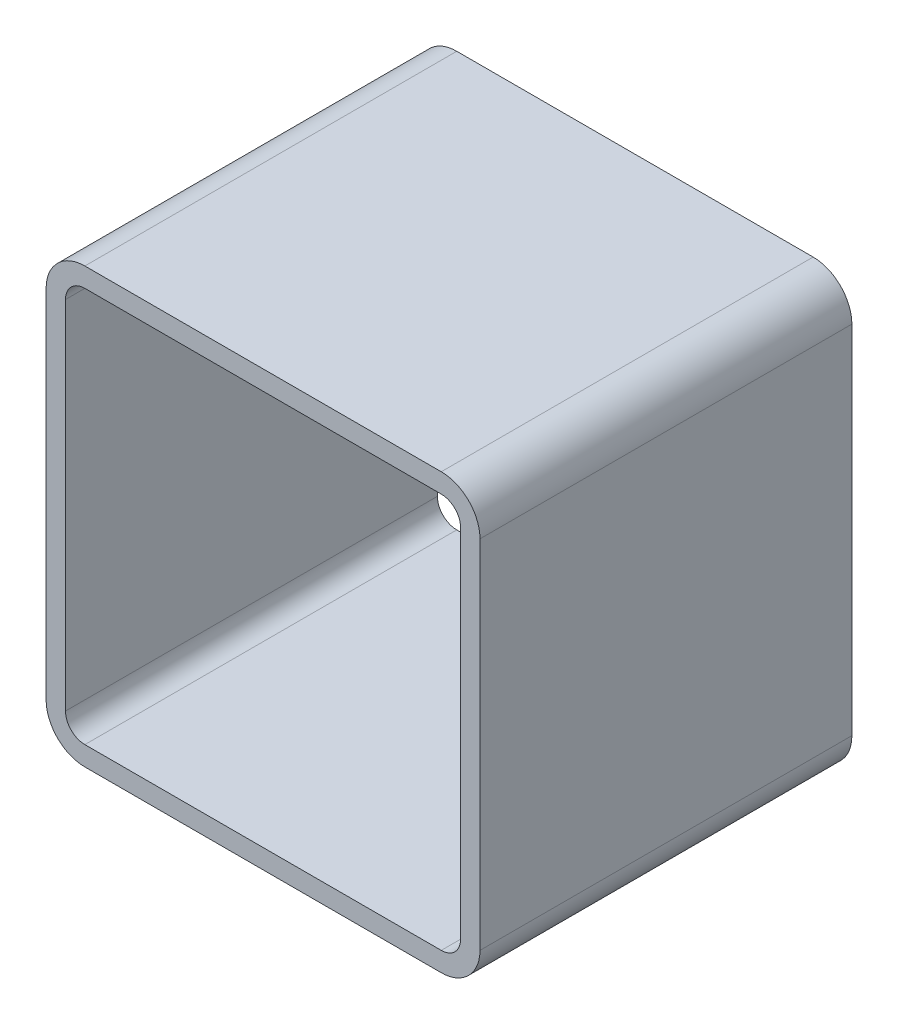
ISO-10303-21;
HEADER;
FILE_DESCRIPTION(('STEP AP214'),'2;1');
FILE_NAME('part.step','',(''),(''),'','','');
FILE_SCHEMA(('AUTOMOTIVE_DESIGN { 1 0 10303 214 1 1 1 1 }'));
ENDSEC;
DATA;
#1=APPLICATION_CONTEXT('core data for automotive mechanical design processes');
#2=APPLICATION_PROTOCOL_DEFINITION('international standard','automotive_design',2000,#1);
#3=PRODUCT_CONTEXT('',#1,'mechanical');
#4=PRODUCT('Part','Part','',(#3));
#5=PRODUCT_RELATED_PRODUCT_CATEGORY('part','',(#4));
#6=PRODUCT_DEFINITION_FORMATION('','',#4);
#7=PRODUCT_DEFINITION_CONTEXT('part definition',#1,'design');
#8=PRODUCT_DEFINITION('design','',#6,#7);
#9=PRODUCT_DEFINITION_SHAPE('','',#8);
#10=(LENGTH_UNIT() NAMED_UNIT(*) SI_UNIT(.MILLI.,.METRE.));
#11=(NAMED_UNIT(*) PLANE_ANGLE_UNIT() SI_UNIT($,.RADIAN.));
#12=(NAMED_UNIT(*) SI_UNIT($,.STERADIAN.) SOLID_ANGLE_UNIT());
#13=UNCERTAINTY_MEASURE_WITH_UNIT(LENGTH_MEASURE(1.E-05),#10,'distance_accuracy_value','');
#14=(GEOMETRIC_REPRESENTATION_CONTEXT(3) GLOBAL_UNCERTAINTY_ASSIGNED_CONTEXT((#13)) GLOBAL_UNIT_ASSIGNED_CONTEXT((#10,
#11,#12)) REPRESENTATION_CONTEXT('',''));
#15=CARTESIAN_POINT('',(0.,0.,0.));
#16=DIRECTION('',(0.,0.,1.));
#17=DIRECTION('',(1.,0.,0.));
#18=AXIS2_PLACEMENT_3D('',#15,#16,#17);
#19=CARTESIAN_POINT('',(34.2003420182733,325.678679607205,304.8));
#20=DIRECTION('',(0.,0.,1.));
#21=DIRECTION('',(1.,0.,0.));
#22=AXIS2_PLACEMENT_3D('',#19,#20,#21);
#23=PLANE('',#22);
#24=CARTESIAN_POINT('',(34.2003420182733,325.678679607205,304.8));
#25=DIRECTION('',(0.,0.,1.));
#26=DIRECTION('',(1.,0.,0.));
#27=AXIS2_PLACEMENT_3D('',#24,#25,#26);
#28=CIRCLE('',#27,31.75);
#29=CARTESIAN_POINT('',(34.2003420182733,357.428679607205,304.8));
#30=VERTEX_POINT('',#29);
#31=CARTESIAN_POINT('',(2.45034201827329,325.678679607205,304.8));
#32=VERTEX_POINT('',#31);
#33=EDGE_CURVE('E211',#30,#32,#28,.T.);
#34=ORIENTED_EDGE('',*,*,#33,.T.);
#35=DIRECTION('',(0.,-1.,0.));
#36=VECTOR('',#35,1.);
#37=CARTESIAN_POINT('',(2.45034201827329,33.5786796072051,304.8));
#38=LINE('',#37,#36);
#39=CARTESIAN_POINT('',(2.45034201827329,33.5786796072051,304.8));
#40=VERTEX_POINT('',#39);
#41=EDGE_CURVE('E214',#32,#40,#38,.T.);
#42=ORIENTED_EDGE('',*,*,#41,.T.);
#43=CARTESIAN_POINT('',(34.2003420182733,33.5786796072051,304.8));
#44=DIRECTION('',(0.,0.,1.));
#45=DIRECTION('',(1.,0.,0.));
#46=AXIS2_PLACEMENT_3D('',#43,#44,#45);
#47=CIRCLE('',#46,31.75);
#48=CARTESIAN_POINT('',(34.2003420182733,1.82867960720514,304.8));
#49=VERTEX_POINT('',#48);
#50=EDGE_CURVE('E217',#40,#49,#47,.T.);
#51=ORIENTED_EDGE('',*,*,#50,.T.);
#52=DIRECTION('',(1.,0.,0.));
#53=VECTOR('',#52,1.);
#54=CARTESIAN_POINT('',(326.300342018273,1.82867960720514,304.8));
#55=LINE('',#54,#53);
#56=CARTESIAN_POINT('',(326.300342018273,1.82867960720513,304.8));
#57=VERTEX_POINT('',#56);
#58=EDGE_CURVE('E219',#49,#57,#55,.T.);
#59=ORIENTED_EDGE('',*,*,#58,.T.);
#60=CARTESIAN_POINT('',(326.300342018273,33.5786796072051,304.8));
#61=DIRECTION('',(0.,0.,1.));
#62=DIRECTION('',(1.,0.,0.));
#63=AXIS2_PLACEMENT_3D('',#60,#61,#62);
#64=CIRCLE('',#63,31.75);
#65=CARTESIAN_POINT('',(358.050342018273,33.5786796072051,304.8));
#66=VERTEX_POINT('',#65);
#67=EDGE_CURVE('E221',#57,#66,#64,.T.);
#68=ORIENTED_EDGE('',*,*,#67,.T.);
#69=DIRECTION('',(0.,1.,0.));
#70=VECTOR('',#69,1.);
#71=CARTESIAN_POINT('',(358.050342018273,325.678679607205,304.8));
#72=LINE('',#71,#70);
#73=CARTESIAN_POINT('',(358.050342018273,325.678679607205,304.8));
#74=VERTEX_POINT('',#73);
#75=EDGE_CURVE('E223',#66,#74,#72,.T.);
#76=ORIENTED_EDGE('',*,*,#75,.T.);
#77=CARTESIAN_POINT('',(326.300342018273,325.678679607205,304.8));
#78=DIRECTION('',(0.,0.,1.));
#79=DIRECTION('',(1.,0.,0.));
#80=AXIS2_PLACEMENT_3D('',#77,#78,#79);
#81=CIRCLE('',#80,31.75);
#82=CARTESIAN_POINT('',(326.300342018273,357.428679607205,304.8));
#83=VERTEX_POINT('',#82);
#84=EDGE_CURVE('E225',#74,#83,#81,.T.);
#85=ORIENTED_EDGE('',*,*,#84,.T.);
#86=DIRECTION('',(-1.,0.,0.));
#87=VECTOR('',#86,1.);
#88=CARTESIAN_POINT('',(34.2003420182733,357.428679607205,304.8));
#89=LINE('',#88,#87);
#90=EDGE_CURVE('E227',#83,#30,#89,.T.);
#91=ORIENTED_EDGE('',*,*,#90,.T.);
#92=EDGE_LOOP('',(#34,#42,#51,#59,#68,#76,#85,#91));
#93=FACE_BOUND('',#92,.T.);
#94=DIRECTION('',(0.,-1.,0.));
#95=VECTOR('',#94,1.);
#96=CARTESIAN_POINT('',(18.3253420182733,33.5786796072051,304.8));
#97=LINE('',#96,#95);
#98=CARTESIAN_POINT('',(18.3253420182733,325.678679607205,304.8));
#99=VERTEX_POINT('',#98);
#100=CARTESIAN_POINT('',(18.3253420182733,33.5786796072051,304.8));
#101=VERTEX_POINT('',#100);
#102=EDGE_CURVE('E154',#99,#101,#97,.T.);
#103=ORIENTED_EDGE('',*,*,#102,.F.);
#104=CARTESIAN_POINT('',(34.2003420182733,325.678679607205,304.8));
#105=DIRECTION('',(0.,0.,1.));
#106=DIRECTION('',(1.,0.,0.));
#107=AXIS2_PLACEMENT_3D('',#104,#105,#106);
#108=CIRCLE('',#107,15.875);
#109=CARTESIAN_POINT('',(34.2003420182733,341.553679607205,304.8));
#110=VERTEX_POINT('',#109);
#111=EDGE_CURVE('E146',#110,#99,#108,.T.);
#112=ORIENTED_EDGE('',*,*,#111,.F.);
#113=DIRECTION('',(-1.,0.,0.));
#114=VECTOR('',#113,1.);
#115=CARTESIAN_POINT('',(34.2003420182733,341.553679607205,304.8));
#116=LINE('',#115,#114);
#117=CARTESIAN_POINT('',(326.300342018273,341.553679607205,304.8));
#118=VERTEX_POINT('',#117);
#119=EDGE_CURVE('E179',#118,#110,#116,.T.);
#120=ORIENTED_EDGE('',*,*,#119,.F.);
#121=CARTESIAN_POINT('',(326.300342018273,325.678679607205,304.8));
#122=DIRECTION('',(0.,0.,1.));
#123=DIRECTION('',(1.,0.,0.));
#124=AXIS2_PLACEMENT_3D('',#121,#122,#123);
#125=CIRCLE('',#124,15.875);
#126=CARTESIAN_POINT('',(342.175342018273,325.678679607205,304.8));
#127=VERTEX_POINT('',#126);
#128=EDGE_CURVE('E177',#127,#118,#125,.T.);
#129=ORIENTED_EDGE('',*,*,#128,.F.);
#130=DIRECTION('',(0.,1.,0.));
#131=VECTOR('',#130,1.);
#132=CARTESIAN_POINT('',(342.175342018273,325.678679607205,304.8));
#133=LINE('',#132,#131);
#134=CARTESIAN_POINT('',(342.175342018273,33.5786796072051,304.8));
#135=VERTEX_POINT('',#134);
#136=EDGE_CURVE('E175',#135,#127,#133,.T.);
#137=ORIENTED_EDGE('',*,*,#136,.F.);
#138=CARTESIAN_POINT('',(326.300342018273,33.5786796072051,304.8));
#139=DIRECTION('',(0.,0.,1.));
#140=DIRECTION('',(1.,0.,0.));
#141=AXIS2_PLACEMENT_3D('',#138,#139,#140);
#142=CIRCLE('',#141,15.875);
#143=CARTESIAN_POINT('',(326.300342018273,17.7036796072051,304.8));
#144=VERTEX_POINT('',#143);
#145=EDGE_CURVE('E173',#144,#135,#142,.T.);
#146=ORIENTED_EDGE('',*,*,#145,.F.);
#147=DIRECTION('',(1.,0.,0.));
#148=VECTOR('',#147,1.);
#149=CARTESIAN_POINT('',(326.300342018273,17.7036796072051,304.8));
#150=LINE('',#149,#148);
#151=CARTESIAN_POINT('',(34.2003420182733,17.7036796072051,304.8));
#152=VERTEX_POINT('',#151);
#153=EDGE_CURVE('E169',#152,#144,#150,.T.);
#154=ORIENTED_EDGE('',*,*,#153,.F.);
#155=CARTESIAN_POINT('',(34.2003420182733,33.5786796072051,304.8));
#156=DIRECTION('',(0.,0.,1.));
#157=DIRECTION('',(1.,0.,0.));
#158=AXIS2_PLACEMENT_3D('',#155,#156,#157);
#159=CIRCLE('',#158,15.875);
#160=EDGE_CURVE('E167',#101,#152,#159,.T.);
#161=ORIENTED_EDGE('',*,*,#160,.F.);
#162=EDGE_LOOP('',(#103,#112,#120,#129,#137,#146,#154,#161));
#163=FACE_BOUND('',#162,.T.);
#164=ADVANCED_FACE('F33',(#93,#163),#23,.T.);
#165=CARTESIAN_POINT('',(34.2003420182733,325.678679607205,0.));
#166=DIRECTION('',(0.,0.,1.));
#167=DIRECTION('',(1.,0.,0.));
#168=AXIS2_PLACEMENT_3D('',#165,#166,#167);
#169=PLANE('',#168);
#170=CARTESIAN_POINT('',(34.2003420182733,325.678679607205,0.));
#171=DIRECTION('',(0.,0.,1.));
#172=DIRECTION('',(1.,0.,0.));
#173=AXIS2_PLACEMENT_3D('',#170,#171,#172);
#174=CIRCLE('',#173,31.75);
#175=CARTESIAN_POINT('',(34.2003420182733,357.428679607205,0.));
#176=VERTEX_POINT('',#175);
#177=CARTESIAN_POINT('',(2.45034201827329,325.678679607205,0.));
#178=VERTEX_POINT('',#177);
#179=EDGE_CURVE('E162',#176,#178,#174,.T.);
#180=ORIENTED_EDGE('',*,*,#179,.F.);
#181=DIRECTION('',(-1.,0.,0.));
#182=VECTOR('',#181,1.);
#183=CARTESIAN_POINT('',(34.2003420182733,357.428679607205,0.));
#184=LINE('',#183,#182);
#185=CARTESIAN_POINT('',(326.300342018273,357.428679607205,0.));
#186=VERTEX_POINT('',#185);
#187=EDGE_CURVE('E215',#186,#176,#184,.T.);
#188=ORIENTED_EDGE('',*,*,#187,.F.);
#189=CARTESIAN_POINT('',(326.300342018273,325.678679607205,0.));
#190=DIRECTION('',(0.,0.,1.));
#191=DIRECTION('',(1.,0.,0.));
#192=AXIS2_PLACEMENT_3D('',#189,#190,#191);
#193=CIRCLE('',#192,31.75);
#194=CARTESIAN_POINT('',(358.050342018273,325.678679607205,0.));
#195=VERTEX_POINT('',#194);
#196=EDGE_CURVE('E242',#195,#186,#193,.T.);
#197=ORIENTED_EDGE('',*,*,#196,.F.);
#198=DIRECTION('',(0.,1.,0.));
#199=VECTOR('',#198,1.);
#200=CARTESIAN_POINT('',(358.050342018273,325.678679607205,0.));
#201=LINE('',#200,#199);
#202=CARTESIAN_POINT('',(358.050342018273,33.5786796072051,0.));
#203=VERTEX_POINT('',#202);
#204=EDGE_CURVE('E240',#203,#195,#201,.T.);
#205=ORIENTED_EDGE('',*,*,#204,.F.);
#206=CARTESIAN_POINT('',(326.300342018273,33.5786796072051,0.));
#207=DIRECTION('',(0.,0.,1.));
#208=DIRECTION('',(1.,0.,0.));
#209=AXIS2_PLACEMENT_3D('',#206,#207,#208);
#210=CIRCLE('',#209,31.75);
#211=CARTESIAN_POINT('',(326.300342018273,1.82867960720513,0.));
#212=VERTEX_POINT('',#211);
#213=EDGE_CURVE('E238',#212,#203,#210,.T.);
#214=ORIENTED_EDGE('',*,*,#213,.F.);
#215=DIRECTION('',(1.,0.,0.));
#216=VECTOR('',#215,1.);
#217=CARTESIAN_POINT('',(326.300342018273,1.82867960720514,0.));
#218=LINE('',#217,#216);
#219=CARTESIAN_POINT('',(34.2003420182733,1.82867960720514,0.));
#220=VERTEX_POINT('',#219);
#221=EDGE_CURVE('E236',#220,#212,#218,.T.);
#222=ORIENTED_EDGE('',*,*,#221,.F.);
#223=CARTESIAN_POINT('',(34.2003420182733,33.5786796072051,0.));
#224=DIRECTION('',(0.,0.,1.));
#225=DIRECTION('',(1.,0.,0.));
#226=AXIS2_PLACEMENT_3D('',#223,#224,#225);
#227=CIRCLE('',#226,31.75);
#228=CARTESIAN_POINT('',(2.45034201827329,33.5786796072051,0.));
#229=VERTEX_POINT('',#228);
#230=EDGE_CURVE('E234',#229,#220,#227,.T.);
#231=ORIENTED_EDGE('',*,*,#230,.F.);
#232=DIRECTION('',(0.,-1.,0.));
#233=VECTOR('',#232,1.);
#234=CARTESIAN_POINT('',(2.45034201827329,33.5786796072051,0.));
#235=LINE('',#234,#233);
#236=EDGE_CURVE('E232',#178,#229,#235,.T.);
#237=ORIENTED_EDGE('',*,*,#236,.F.);
#238=EDGE_LOOP('',(#180,#188,#197,#205,#214,#222,#231,#237));
#239=FACE_BOUND('',#238,.T.);
#240=CARTESIAN_POINT('',(34.2003420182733,325.678679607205,0.));
#241=DIRECTION('',(0.,0.,1.));
#242=DIRECTION('',(1.,0.,0.));
#243=AXIS2_PLACEMENT_3D('',#240,#241,#242);
#244=CIRCLE('',#243,15.875);
#245=CARTESIAN_POINT('',(34.2003420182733,341.553679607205,0.));
#246=VERTEX_POINT('',#245);
#247=CARTESIAN_POINT('',(18.3253420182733,325.678679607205,0.));
#248=VERTEX_POINT('',#247);
#249=EDGE_CURVE('E56',#246,#248,#244,.T.);
#250=ORIENTED_EDGE('',*,*,#249,.T.);
#251=DIRECTION('',(0.,-1.,0.));
#252=VECTOR('',#251,1.);
#253=CARTESIAN_POINT('',(18.3253420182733,33.5786796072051,0.));
#254=LINE('',#253,#252);
#255=CARTESIAN_POINT('',(18.3253420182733,33.5786796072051,0.));
#256=VERTEX_POINT('',#255);
#257=EDGE_CURVE('E161',#248,#256,#254,.T.);
#258=ORIENTED_EDGE('',*,*,#257,.T.);
#259=CARTESIAN_POINT('',(34.2003420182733,33.5786796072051,0.));
#260=DIRECTION('',(0.,0.,1.));
#261=DIRECTION('',(1.,0.,0.));
#262=AXIS2_PLACEMENT_3D('',#259,#260,#261);
#263=CIRCLE('',#262,15.875);
#264=CARTESIAN_POINT('',(34.2003420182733,17.7036796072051,0.));
#265=VERTEX_POINT('',#264);
#266=EDGE_CURVE('E183',#256,#265,#263,.T.);
#267=ORIENTED_EDGE('',*,*,#266,.T.);
#268=DIRECTION('',(1.,0.,0.));
#269=VECTOR('',#268,1.);
#270=CARTESIAN_POINT('',(326.300342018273,17.7036796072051,0.));
#271=LINE('',#270,#269);
#272=CARTESIAN_POINT('',(326.300342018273,17.7036796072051,0.));
#273=VERTEX_POINT('',#272);
#274=EDGE_CURVE('E186',#265,#273,#271,.T.);
#275=ORIENTED_EDGE('',*,*,#274,.T.);
#276=CARTESIAN_POINT('',(326.300342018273,33.5786796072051,0.));
#277=DIRECTION('',(0.,0.,1.));
#278=DIRECTION('',(1.,0.,0.));
#279=AXIS2_PLACEMENT_3D('',#276,#277,#278);
#280=CIRCLE('',#279,15.875);
#281=CARTESIAN_POINT('',(342.175342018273,33.5786796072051,0.));
#282=VERTEX_POINT('',#281);
#283=EDGE_CURVE('E189',#273,#282,#280,.T.);
#284=ORIENTED_EDGE('',*,*,#283,.T.);
#285=DIRECTION('',(0.,1.,0.));
#286=VECTOR('',#285,1.);
#287=CARTESIAN_POINT('',(342.175342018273,325.678679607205,0.));
#288=LINE('',#287,#286);
#289=CARTESIAN_POINT('',(342.175342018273,325.678679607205,0.));
#290=VERTEX_POINT('',#289);
#291=EDGE_CURVE('E192',#282,#290,#288,.T.);
#292=ORIENTED_EDGE('',*,*,#291,.T.);
#293=CARTESIAN_POINT('',(326.300342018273,325.678679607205,0.));
#294=DIRECTION('',(0.,0.,1.));
#295=DIRECTION('',(1.,0.,0.));
#296=AXIS2_PLACEMENT_3D('',#293,#294,#295);
#297=CIRCLE('',#296,15.875);
#298=CARTESIAN_POINT('',(326.300342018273,341.553679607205,0.));
#299=VERTEX_POINT('',#298);
#300=EDGE_CURVE('E195',#290,#299,#297,.T.);
#301=ORIENTED_EDGE('',*,*,#300,.T.);
#302=DIRECTION('',(-1.,0.,0.));
#303=VECTOR('',#302,1.);
#304=CARTESIAN_POINT('',(34.2003420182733,341.553679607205,0.));
#305=LINE('',#304,#303);
#306=EDGE_CURVE('E155',#299,#246,#305,.T.);
#307=ORIENTED_EDGE('',*,*,#306,.T.);
#308=EDGE_LOOP('',(#250,#258,#267,#275,#284,#292,#301,#307));
#309=FACE_BOUND('',#308,.T.);
#310=ADVANCED_FACE('F272',(#239,#309),#169,.F.);
#311=CARTESIAN_POINT('',(34.2003420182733,325.678679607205,304.8));
#312=DIRECTION('',(0.,0.,-1.));
#313=DIRECTION('',(-1.,0.,0.));
#314=AXIS2_PLACEMENT_3D('',#311,#312,#313);
#315=CYLINDRICAL_SURFACE('',#314,31.75);
#316=ORIENTED_EDGE('',*,*,#179,.T.);
#317=DIRECTION('',(0.,0.,-1.));
#318=VECTOR('',#317,1.);
#319=CARTESIAN_POINT('',(2.45034201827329,325.678679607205,304.8));
#320=LINE('',#319,#318);
#321=EDGE_CURVE('E11',#32,#178,#320,.T.);
#322=ORIENTED_EDGE('',*,*,#321,.F.);
#323=ORIENTED_EDGE('',*,*,#33,.F.);
#324=DIRECTION('',(0.,0.,-1.));
#325=VECTOR('',#324,1.);
#326=CARTESIAN_POINT('',(34.2003420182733,357.428679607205,304.8));
#327=LINE('',#326,#325);
#328=EDGE_CURVE('E229',#30,#176,#327,.T.);
#329=ORIENTED_EDGE('',*,*,#328,.T.);
#330=EDGE_LOOP('',(#316,#322,#323,#329));
#331=FACE_BOUND('',#330,.T.);
#332=ADVANCED_FACE('F35',(#331),#315,.T.);
#333=CARTESIAN_POINT('',(2.45034201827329,33.5786796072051,304.8));
#334=DIRECTION('',(1.,0.,0.));
#335=DIRECTION('',(0.,0.,-1.));
#336=AXIS2_PLACEMENT_3D('',#333,#334,#335);
#337=PLANE('',#336);
#338=ORIENTED_EDGE('',*,*,#236,.T.);
#339=DIRECTION('',(0.,0.,-1.));
#340=VECTOR('',#339,1.);
#341=CARTESIAN_POINT('',(2.45034201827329,33.5786796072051,304.8));
#342=LINE('',#341,#340);
#343=EDGE_CURVE('E41',#40,#229,#342,.T.);
#344=ORIENTED_EDGE('',*,*,#343,.F.);
#345=ORIENTED_EDGE('',*,*,#41,.F.);
#346=ORIENTED_EDGE('',*,*,#321,.T.);
#347=EDGE_LOOP('',(#338,#344,#345,#346));
#348=FACE_BOUND('',#347,.T.);
#349=ADVANCED_FACE('F289',(#348),#337,.F.);
#350=CARTESIAN_POINT('',(34.2003420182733,33.5786796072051,304.8));
#351=DIRECTION('',(0.,0.,-1.));
#352=DIRECTION('',(-1.,0.,0.));
#353=AXIS2_PLACEMENT_3D('',#350,#351,#352);
#354=CYLINDRICAL_SURFACE('',#353,31.75);
#355=ORIENTED_EDGE('',*,*,#230,.T.);
#356=DIRECTION('',(0.,0.,-1.));
#357=VECTOR('',#356,1.);
#358=CARTESIAN_POINT('',(34.2003420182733,1.82867960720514,304.8));
#359=LINE('',#358,#357);
#360=EDGE_CURVE('E259',#49,#220,#359,.T.);
#361=ORIENTED_EDGE('',*,*,#360,.F.);
#362=ORIENTED_EDGE('',*,*,#50,.F.);
#363=ORIENTED_EDGE('',*,*,#343,.T.);
#364=EDGE_LOOP('',(#355,#361,#362,#363));
#365=FACE_BOUND('',#364,.T.);
#366=ADVANCED_FACE('F266',(#365),#354,.T.);
#367=CARTESIAN_POINT('',(326.300342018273,1.82867960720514,304.8));
#368=DIRECTION('',(0.,1.,0.));
#369=DIRECTION('',(0.,0.,1.));
#370=AXIS2_PLACEMENT_3D('',#367,#368,#369);
#371=PLANE('',#370);
#372=ORIENTED_EDGE('',*,*,#221,.T.);
#373=DIRECTION('',(0.,0.,-1.));
#374=VECTOR('',#373,1.);
#375=CARTESIAN_POINT('',(326.300342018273,1.82867960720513,304.8));
#376=LINE('',#375,#374);
#377=EDGE_CURVE('E256',#57,#212,#376,.T.);
#378=ORIENTED_EDGE('',*,*,#377,.F.);
#379=ORIENTED_EDGE('',*,*,#58,.F.);
#380=ORIENTED_EDGE('',*,*,#360,.T.);
#381=EDGE_LOOP('',(#372,#378,#379,#380));
#382=FACE_BOUND('',#381,.T.);
#383=ADVANCED_FACE('F278',(#382),#371,.F.);
#384=CARTESIAN_POINT('',(326.300342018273,33.5786796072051,304.8));
#385=DIRECTION('',(0.,0.,-1.));
#386=DIRECTION('',(-1.,0.,0.));
#387=AXIS2_PLACEMENT_3D('',#384,#385,#386);
#388=CYLINDRICAL_SURFACE('',#387,31.75);
#389=ORIENTED_EDGE('',*,*,#213,.T.);
#390=DIRECTION('',(0.,0.,-1.));
#391=VECTOR('',#390,1.);
#392=CARTESIAN_POINT('',(358.050342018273,33.5786796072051,304.8));
#393=LINE('',#392,#391);
#394=EDGE_CURVE('E253',#66,#203,#393,.T.);
#395=ORIENTED_EDGE('',*,*,#394,.F.);
#396=ORIENTED_EDGE('',*,*,#67,.F.);
#397=ORIENTED_EDGE('',*,*,#377,.T.);
#398=EDGE_LOOP('',(#389,#395,#396,#397));
#399=FACE_BOUND('',#398,.T.);
#400=ADVANCED_FACE('F282',(#399),#388,.T.);
#401=CARTESIAN_POINT('',(358.050342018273,325.678679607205,304.8));
#402=DIRECTION('',(-1.,0.,0.));
#403=DIRECTION('',(0.,0.,1.));
#404=AXIS2_PLACEMENT_3D('',#401,#402,#403);
#405=PLANE('',#404);
#406=ORIENTED_EDGE('',*,*,#204,.T.);
#407=DIRECTION('',(0.,0.,-1.));
#408=VECTOR('',#407,1.);
#409=CARTESIAN_POINT('',(358.050342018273,325.678679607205,304.8));
#410=LINE('',#409,#408);
#411=EDGE_CURVE('E250',#74,#195,#410,.T.);
#412=ORIENTED_EDGE('',*,*,#411,.F.);
#413=ORIENTED_EDGE('',*,*,#75,.F.);
#414=ORIENTED_EDGE('',*,*,#394,.T.);
#415=EDGE_LOOP('',(#406,#412,#413,#414));
#416=FACE_BOUND('',#415,.T.);
#417=ADVANCED_FACE('F302',(#416),#405,.F.);
#418=CARTESIAN_POINT('',(326.300342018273,325.678679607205,304.8));
#419=DIRECTION('',(0.,0.,-1.));
#420=DIRECTION('',(-1.,0.,0.));
#421=AXIS2_PLACEMENT_3D('',#418,#419,#420);
#422=CYLINDRICAL_SURFACE('',#421,31.75);
#423=ORIENTED_EDGE('',*,*,#196,.T.);
#424=DIRECTION('',(0.,0.,-1.));
#425=VECTOR('',#424,1.);
#426=CARTESIAN_POINT('',(326.300342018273,357.428679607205,304.8));
#427=LINE('',#426,#425);
#428=EDGE_CURVE('E247',#83,#186,#427,.T.);
#429=ORIENTED_EDGE('',*,*,#428,.F.);
#430=ORIENTED_EDGE('',*,*,#84,.F.);
#431=ORIENTED_EDGE('',*,*,#411,.T.);
#432=EDGE_LOOP('',(#423,#429,#430,#431));
#433=FACE_BOUND('',#432,.T.);
#434=ADVANCED_FACE('F300',(#433),#422,.T.);
#435=CARTESIAN_POINT('',(34.2003420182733,357.428679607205,304.8));
#436=DIRECTION('',(0.,-1.,0.));
#437=DIRECTION('',(0.,0.,-1.));
#438=AXIS2_PLACEMENT_3D('',#435,#436,#437);
#439=PLANE('',#438);
#440=ORIENTED_EDGE('',*,*,#187,.T.);
#441=ORIENTED_EDGE('',*,*,#328,.F.);
#442=ORIENTED_EDGE('',*,*,#90,.F.);
#443=ORIENTED_EDGE('',*,*,#428,.T.);
#444=EDGE_LOOP('',(#440,#441,#442,#443));
#445=FACE_BOUND('',#444,.T.);
#446=ADVANCED_FACE('F295',(#445),#439,.F.);
#447=CARTESIAN_POINT('',(34.2003420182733,325.678679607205,304.8));
#448=DIRECTION('',(0.,0.,-1.));
#449=DIRECTION('',(-1.,0.,0.));
#450=AXIS2_PLACEMENT_3D('',#447,#448,#449);
#451=CYLINDRICAL_SURFACE('',#450,15.875);
#452=ORIENTED_EDGE('',*,*,#249,.F.);
#453=DIRECTION('',(0.,0.,-1.));
#454=VECTOR('',#453,1.);
#455=CARTESIAN_POINT('',(34.2003420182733,341.553679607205,304.8));
#456=LINE('',#455,#454);
#457=EDGE_CURVE('E150',#110,#246,#456,.T.);
#458=ORIENTED_EDGE('',*,*,#457,.F.);
#459=ORIENTED_EDGE('',*,*,#111,.T.);
#460=DIRECTION('',(0.,0.,-1.));
#461=VECTOR('',#460,1.);
#462=CARTESIAN_POINT('',(18.3253420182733,325.678679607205,304.8));
#463=LINE('',#462,#461);
#464=EDGE_CURVE('E149',#99,#248,#463,.T.);
#465=ORIENTED_EDGE('',*,*,#464,.T.);
#466=EDGE_LOOP('',(#452,#458,#459,#465));
#467=FACE_BOUND('',#466,.T.);
#468=ADVANCED_FACE('F148',(#467),#451,.F.);
#469=CARTESIAN_POINT('',(18.3253420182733,33.5786796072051,304.8));
#470=DIRECTION('',(1.,0.,0.));
#471=DIRECTION('',(0.,0.,-1.));
#472=AXIS2_PLACEMENT_3D('',#469,#470,#471);
#473=PLANE('',#472);
#474=ORIENTED_EDGE('',*,*,#257,.F.);
#475=ORIENTED_EDGE('',*,*,#464,.F.);
#476=ORIENTED_EDGE('',*,*,#102,.T.);
#477=DIRECTION('',(0.,0.,-1.));
#478=VECTOR('',#477,1.);
#479=CARTESIAN_POINT('',(18.3253420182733,33.5786796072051,304.8));
#480=LINE('',#479,#478);
#481=EDGE_CURVE('E163',#101,#256,#480,.T.);
#482=ORIENTED_EDGE('',*,*,#481,.T.);
#483=EDGE_LOOP('',(#474,#475,#476,#482));
#484=FACE_BOUND('',#483,.T.);
#485=ADVANCED_FACE('F158',(#484),#473,.T.);
#486=CARTESIAN_POINT('',(34.2003420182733,33.5786796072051,304.8));
#487=DIRECTION('',(0.,0.,-1.));
#488=DIRECTION('',(-1.,0.,0.));
#489=AXIS2_PLACEMENT_3D('',#486,#487,#488);
#490=CYLINDRICAL_SURFACE('',#489,15.875);
#491=ORIENTED_EDGE('',*,*,#266,.F.);
#492=ORIENTED_EDGE('',*,*,#481,.F.);
#493=ORIENTED_EDGE('',*,*,#160,.T.);
#494=DIRECTION('',(0.,0.,-1.));
#495=VECTOR('',#494,1.);
#496=CARTESIAN_POINT('',(34.2003420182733,17.7036796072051,304.8));
#497=LINE('',#496,#495);
#498=EDGE_CURVE('E208',#152,#265,#497,.T.);
#499=ORIENTED_EDGE('',*,*,#498,.T.);
#500=EDGE_LOOP('',(#491,#492,#493,#499));
#501=FACE_BOUND('',#500,.T.);
#502=ADVANCED_FACE('F327',(#501),#490,.F.);
#503=CARTESIAN_POINT('',(326.300342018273,17.7036796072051,304.8));
#504=DIRECTION('',(0.,1.,0.));
#505=DIRECTION('',(0.,0.,1.));
#506=AXIS2_PLACEMENT_3D('',#503,#504,#505);
#507=PLANE('',#506);
#508=ORIENTED_EDGE('',*,*,#274,.F.);
#509=ORIENTED_EDGE('',*,*,#498,.F.);
#510=ORIENTED_EDGE('',*,*,#153,.T.);
#511=DIRECTION('',(0.,0.,-1.));
#512=VECTOR('',#511,1.);
#513=CARTESIAN_POINT('',(326.300342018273,17.7036796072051,304.8));
#514=LINE('',#513,#512);
#515=EDGE_CURVE('E206',#144,#273,#514,.T.);
#516=ORIENTED_EDGE('',*,*,#515,.T.);
#517=EDGE_LOOP('',(#508,#509,#510,#516));
#518=FACE_BOUND('',#517,.T.);
#519=ADVANCED_FACE('F331',(#518),#507,.T.);
#520=CARTESIAN_POINT('',(326.300342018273,33.5786796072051,304.8));
#521=DIRECTION('',(0.,0.,-1.));
#522=DIRECTION('',(-1.,0.,0.));
#523=AXIS2_PLACEMENT_3D('',#520,#521,#522);
#524=CYLINDRICAL_SURFACE('',#523,15.875);
#525=ORIENTED_EDGE('',*,*,#283,.F.);
#526=ORIENTED_EDGE('',*,*,#515,.F.);
#527=ORIENTED_EDGE('',*,*,#145,.T.);
#528=DIRECTION('',(0.,0.,-1.));
#529=VECTOR('',#528,1.);
#530=CARTESIAN_POINT('',(342.175342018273,33.5786796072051,304.8));
#531=LINE('',#530,#529);
#532=EDGE_CURVE('E204',#135,#282,#531,.T.);
#533=ORIENTED_EDGE('',*,*,#532,.T.);
#534=EDGE_LOOP('',(#525,#526,#527,#533));
#535=FACE_BOUND('',#534,.T.);
#536=ADVANCED_FACE('F337',(#535),#524,.F.);
#537=CARTESIAN_POINT('',(342.175342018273,325.678679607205,304.8));
#538=DIRECTION('',(-1.,0.,0.));
#539=DIRECTION('',(0.,0.,1.));
#540=AXIS2_PLACEMENT_3D('',#537,#538,#539);
#541=PLANE('',#540);
#542=ORIENTED_EDGE('',*,*,#291,.F.);
#543=ORIENTED_EDGE('',*,*,#532,.F.);
#544=ORIENTED_EDGE('',*,*,#136,.T.);
#545=DIRECTION('',(0.,0.,-1.));
#546=VECTOR('',#545,1.);
#547=CARTESIAN_POINT('',(342.175342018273,325.678679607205,304.8));
#548=LINE('',#547,#546);
#549=EDGE_CURVE('E202',#127,#290,#548,.T.);
#550=ORIENTED_EDGE('',*,*,#549,.T.);
#551=EDGE_LOOP('',(#542,#543,#544,#550));
#552=FACE_BOUND('',#551,.T.);
#553=ADVANCED_FACE('F341',(#552),#541,.T.);
#554=CARTESIAN_POINT('',(326.300342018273,325.678679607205,304.8));
#555=DIRECTION('',(0.,0.,-1.));
#556=DIRECTION('',(-1.,0.,0.));
#557=AXIS2_PLACEMENT_3D('',#554,#555,#556);
#558=CYLINDRICAL_SURFACE('',#557,15.875);
#559=ORIENTED_EDGE('',*,*,#300,.F.);
#560=ORIENTED_EDGE('',*,*,#549,.F.);
#561=ORIENTED_EDGE('',*,*,#128,.T.);
#562=DIRECTION('',(0.,0.,-1.));
#563=VECTOR('',#562,1.);
#564=CARTESIAN_POINT('',(326.300342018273,341.553679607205,304.8));
#565=LINE('',#564,#563);
#566=EDGE_CURVE('E48',#118,#299,#565,.T.);
#567=ORIENTED_EDGE('',*,*,#566,.T.);
#568=EDGE_LOOP('',(#559,#560,#561,#567));
#569=FACE_BOUND('',#568,.T.);
#570=ADVANCED_FACE('F345',(#569),#558,.F.);
#571=CARTESIAN_POINT('',(34.2003420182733,341.553679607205,304.8));
#572=DIRECTION('',(0.,-1.,0.));
#573=DIRECTION('',(0.,0.,-1.));
#574=AXIS2_PLACEMENT_3D('',#571,#572,#573);
#575=PLANE('',#574);
#576=ORIENTED_EDGE('',*,*,#306,.F.);
#577=ORIENTED_EDGE('',*,*,#566,.F.);
#578=ORIENTED_EDGE('',*,*,#119,.T.);
#579=ORIENTED_EDGE('',*,*,#457,.T.);
#580=EDGE_LOOP('',(#576,#577,#578,#579));
#581=FACE_BOUND('',#580,.T.);
#582=ADVANCED_FACE('F349',(#581),#575,.T.);
#583=CLOSED_SHELL('',(#164,#310,#332,#349,#366,#383,#400,#417,#434,#446,#468,#485,#502,#519,
#536,#553,#570,#582));
#584=MANIFOLD_SOLID_BREP('B2',#583);
#585=ADVANCED_BREP_SHAPE_REPRESENTATION('',(#18,#584),#14);
#586=SHAPE_DEFINITION_REPRESENTATION(#9,#585);
ENDSEC;
END-ISO-10303-21;
